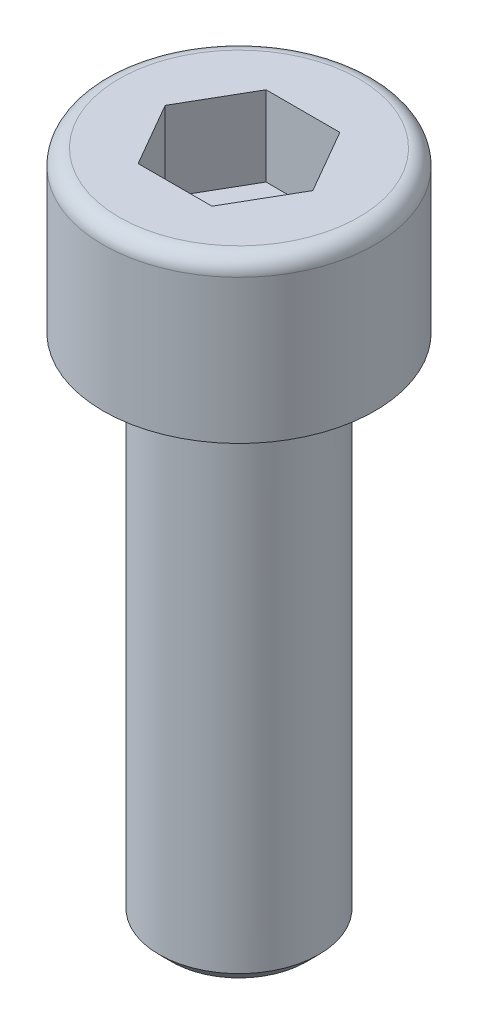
ISO-10303-21;
HEADER;
FILE_DESCRIPTION(('STEP AP214'),'2;1');
FILE_NAME('part.step','',(''),(''),'','','');
FILE_SCHEMA(('AUTOMOTIVE_DESIGN { 1 0 10303 214 1 1 1 1 }'));
ENDSEC;
DATA;
#1=APPLICATION_CONTEXT('core data for automotive mechanical design processes');
#2=APPLICATION_PROTOCOL_DEFINITION('international standard','automotive_design',2000,#1);
#3=PRODUCT_CONTEXT('',#1,'mechanical');
#4=PRODUCT('Part','Part','',(#3));
#5=PRODUCT_RELATED_PRODUCT_CATEGORY('part','',(#4));
#6=PRODUCT_DEFINITION_FORMATION('','',#4);
#7=PRODUCT_DEFINITION_CONTEXT('part definition',#1,'design');
#8=PRODUCT_DEFINITION('design','',#6,#7);
#9=PRODUCT_DEFINITION_SHAPE('','',#8);
#10=(LENGTH_UNIT() NAMED_UNIT(*) SI_UNIT(.MILLI.,.METRE.));
#11=(NAMED_UNIT(*) PLANE_ANGLE_UNIT() SI_UNIT($,.RADIAN.));
#12=(NAMED_UNIT(*) SI_UNIT($,.STERADIAN.) SOLID_ANGLE_UNIT());
#13=UNCERTAINTY_MEASURE_WITH_UNIT(LENGTH_MEASURE(1.E-05),#10,'distance_accuracy_value','');
#14=(GEOMETRIC_REPRESENTATION_CONTEXT(3) GLOBAL_UNCERTAINTY_ASSIGNED_CONTEXT((#13)) GLOBAL_UNIT_ASSIGNED_CONTEXT((#10,
#11,#12)) REPRESENTATION_CONTEXT('',''));
#15=CARTESIAN_POINT('',(0.,0.,0.));
#16=DIRECTION('',(0.,0.,1.));
#17=DIRECTION('',(1.,0.,0.));
#18=AXIS2_PLACEMENT_3D('',#15,#16,#17);
#19=CARTESIAN_POINT('',(-2.50000000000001,0.,0.));
#20=DIRECTION('',(0.,-1.,0.));
#21=DIRECTION('',(0.,0.,-1.));
#22=AXIS2_PLACEMENT_3D('',#19,#20,#21);
#23=PLANE('',#22);
#24=CARTESIAN_POINT('',(0.,0.,0.));
#25=DIRECTION('',(0.,-1.,0.));
#26=DIRECTION('',(0.,0.,-1.));
#27=AXIS2_PLACEMENT_3D('',#24,#25,#26);
#28=CIRCLE('',#27,2.1);
#29=CARTESIAN_POINT('',(0.,0.,-2.1));
#30=VERTEX_POINT('',#29);
#31=EDGE_CURVE('E11',#30,#30,#28,.T.);
#32=ORIENTED_EDGE('',*,*,#31,.T.);
#33=EDGE_LOOP('',(#32));
#34=FACE_BOUND('',#33,.T.);
#35=ADVANCED_FACE('F28',(#34),#23,.T.);
#36=CARTESIAN_POINT('',(0.,23.8098495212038,0.));
#37=DIRECTION('',(0.,1.,0.));
#38=DIRECTION('',(0.,0.,1.));
#39=AXIS2_PLACEMENT_3D('',#36,#37,#38);
#40=CYLINDRICAL_SURFACE('',#39,2.5);
#41=CARTESIAN_POINT('',(0.,0.400000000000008,0.));
#42=DIRECTION('',(0.,-1.,0.));
#43=DIRECTION('',(0.,0.,-1.));
#44=AXIS2_PLACEMENT_3D('',#41,#42,#43);
#45=CIRCLE('',#44,2.5);
#46=CARTESIAN_POINT('',(0.,0.400000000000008,-2.5));
#47=VERTEX_POINT('',#46);
#48=EDGE_CURVE('E35',#47,#47,#45,.F.);
#49=ORIENTED_EDGE('',*,*,#48,.T.);
#50=EDGE_LOOP('',(#49));
#51=FACE_BOUND('',#50,.T.);
#52=CARTESIAN_POINT('',(0.,16.,0.));
#53=DIRECTION('',(0.,1.,0.));
#54=DIRECTION('',(0.,0.,1.));
#55=AXIS2_PLACEMENT_3D('',#52,#53,#54);
#56=CIRCLE('',#55,2.5);
#57=CARTESIAN_POINT('',(0.,16.,2.5));
#58=VERTEX_POINT('',#57);
#59=EDGE_CURVE('E145',#58,#58,#56,.T.);
#60=ORIENTED_EDGE('',*,*,#59,.F.);
#61=EDGE_LOOP('',(#60));
#62=FACE_BOUND('',#61,.T.);
#63=ADVANCED_FACE('F150',(#51,#62),#40,.T.);
#64=CARTESIAN_POINT('',(-4.25,16.,0.));
#65=DIRECTION('',(0.,-1.,0.));
#66=DIRECTION('',(0.,0.,-1.));
#67=AXIS2_PLACEMENT_3D('',#64,#65,#66);
#68=PLANE('',#67);
#69=ORIENTED_EDGE('',*,*,#59,.T.);
#70=EDGE_LOOP('',(#69));
#71=FACE_BOUND('',#70,.T.);
#72=CARTESIAN_POINT('',(0.,16.,0.));
#73=DIRECTION('',(0.,1.,0.));
#74=DIRECTION('',(0.,0.,1.));
#75=AXIS2_PLACEMENT_3D('',#72,#73,#74);
#76=CIRCLE('',#75,4.25);
#77=CARTESIAN_POINT('',(0.,16.,4.25));
#78=VERTEX_POINT('',#77);
#79=EDGE_CURVE('E142',#78,#78,#76,.T.);
#80=ORIENTED_EDGE('',*,*,#79,.F.);
#81=EDGE_LOOP('',(#80));
#82=FACE_BOUND('',#81,.T.);
#83=ADVANCED_FACE('F169',(#71,#82),#68,.T.);
#84=CARTESIAN_POINT('',(0.,23.8098495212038,0.));
#85=DIRECTION('',(0.,1.,0.));
#86=DIRECTION('',(0.,0.,1.));
#87=AXIS2_PLACEMENT_3D('',#84,#85,#86);
#88=CYLINDRICAL_SURFACE('',#87,4.25);
#89=ORIENTED_EDGE('',*,*,#79,.T.);
#90=EDGE_LOOP('',(#89));
#91=FACE_BOUND('',#90,.T.);
#92=CARTESIAN_POINT('',(0.,20.5,0.));
#93=DIRECTION('',(0.,1.,0.));
#94=DIRECTION('',(0.,0.,1.));
#95=AXIS2_PLACEMENT_3D('',#92,#93,#94);
#96=CIRCLE('',#95,4.25);
#97=CARTESIAN_POINT('',(0.,20.5,4.25));
#98=VERTEX_POINT('',#97);
#99=EDGE_CURVE('E139',#98,#98,#96,.T.);
#100=ORIENTED_EDGE('',*,*,#99,.F.);
#101=EDGE_LOOP('',(#100));
#102=FACE_BOUND('',#101,.T.);
#103=ADVANCED_FACE('F173',(#91,#102),#88,.T.);
#104=CARTESIAN_POINT('',(0.,20.5,0.));
#105=DIRECTION('',(0.,1.,0.));
#106=DIRECTION('',(0.,0.,1.));
#107=AXIS2_PLACEMENT_3D('',#104,#105,#106);
#108=TOROIDAL_SURFACE('',#107,3.75,0.500000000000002);
#109=CARTESIAN_POINT('',(0.,21.,0.));
#110=DIRECTION('',(0.,1.,0.));
#111=DIRECTION('',(0.,0.,1.));
#112=AXIS2_PLACEMENT_3D('',#109,#110,#111);
#113=CIRCLE('',#112,3.75);
#114=CARTESIAN_POINT('',(0.,21.,3.75));
#115=VERTEX_POINT('',#114);
#116=EDGE_CURVE('E130',#115,#115,#113,.T.);
#117=ORIENTED_EDGE('',*,*,#116,.F.);
#118=EDGE_LOOP('',(#117));
#119=FACE_BOUND('',#118,.T.);
#120=ORIENTED_EDGE('',*,*,#99,.T.);
#121=EDGE_LOOP('',(#120));
#122=FACE_BOUND('',#121,.T.);
#123=ADVANCED_FACE('F179',(#119,#122),#108,.T.);
#124=CARTESIAN_POINT('',(0.,21.,0.));
#125=DIRECTION('',(0.,1.,0.));
#126=DIRECTION('',(0.,0.,1.));
#127=AXIS2_PLACEMENT_3D('',#124,#125,#126);
#128=PLANE('',#127);
#129=DIRECTION('',(0.5,0.,0.866025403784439));
#130=VECTOR('',#129,1.);
#131=CARTESIAN_POINT('',(-2.3094010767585,21.,0.));
#132=LINE('',#131,#130);
#133=CARTESIAN_POINT('',(-2.3094010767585,21.,0.));
#134=VERTEX_POINT('',#133);
#135=CARTESIAN_POINT('',(-1.15470053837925,21.,2.));
#136=VERTEX_POINT('',#135);
#137=EDGE_CURVE('E42',#134,#136,#132,.T.);
#138=ORIENTED_EDGE('',*,*,#137,.F.);
#139=DIRECTION('',(-0.5,0.,0.866025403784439));
#140=VECTOR('',#139,1.);
#141=CARTESIAN_POINT('',(-1.15470053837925,21.,-2.));
#142=LINE('',#141,#140);
#143=CARTESIAN_POINT('',(-1.15470053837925,21.,-2.));
#144=VERTEX_POINT('',#143);
#145=EDGE_CURVE('E112',#144,#134,#142,.T.);
#146=ORIENTED_EDGE('',*,*,#145,.F.);
#147=DIRECTION('',(-1.,0.,0.));
#148=VECTOR('',#147,1.);
#149=CARTESIAN_POINT('',(1.15470053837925,21.,-2.));
#150=LINE('',#149,#148);
#151=CARTESIAN_POINT('',(1.15470053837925,21.,-2.));
#152=VERTEX_POINT('',#151);
#153=EDGE_CURVE('E106',#152,#144,#150,.T.);
#154=ORIENTED_EDGE('',*,*,#153,.F.);
#155=DIRECTION('',(-0.5,0.,-0.866025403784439));
#156=VECTOR('',#155,1.);
#157=CARTESIAN_POINT('',(2.3094010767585,21.,0.));
#158=LINE('',#157,#156);
#159=CARTESIAN_POINT('',(2.3094010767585,21.,0.));
#160=VERTEX_POINT('',#159);
#161=EDGE_CURVE('E104',#160,#152,#158,.T.);
#162=ORIENTED_EDGE('',*,*,#161,.F.);
#163=DIRECTION('',(0.5,0.,-0.866025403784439));
#164=VECTOR('',#163,1.);
#165=CARTESIAN_POINT('',(1.15470053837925,21.,2.));
#166=LINE('',#165,#164);
#167=CARTESIAN_POINT('',(1.15470053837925,21.,2.));
#168=VERTEX_POINT('',#167);
#169=EDGE_CURVE('E85',#168,#160,#166,.T.);
#170=ORIENTED_EDGE('',*,*,#169,.F.);
#171=DIRECTION('',(1.,0.,0.));
#172=VECTOR('',#171,1.);
#173=CARTESIAN_POINT('',(-1.15470053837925,21.,2.));
#174=LINE('',#173,#172);
#175=EDGE_CURVE('E96',#136,#168,#174,.T.);
#176=ORIENTED_EDGE('',*,*,#175,.F.);
#177=EDGE_LOOP('',(#138,#146,#154,#162,#170,#176));
#178=FACE_BOUND('',#177,.T.);
#179=ORIENTED_EDGE('',*,*,#116,.T.);
#180=EDGE_LOOP('',(#179));
#181=FACE_BOUND('',#180,.T.);
#182=ADVANCED_FACE('F100',(#178,#181),#128,.T.);
#183=CARTESIAN_POINT('',(-2.3094010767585,18.5,0.));
#184=DIRECTION('',(-0.866025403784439,0.,0.5));
#185=DIRECTION('',(0.5,0.,0.866025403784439));
#186=AXIS2_PLACEMENT_3D('',#183,#184,#185);
#187=PLANE('',#186);
#188=ORIENTED_EDGE('',*,*,#137,.T.);
#189=DIRECTION('',(0.,1.,0.));
#190=VECTOR('',#189,1.);
#191=CARTESIAN_POINT('',(-1.15470053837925,18.5,2.));
#192=LINE('',#191,#190);
#193=CARTESIAN_POINT('',(-1.15470053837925,18.5,2.));
#194=VERTEX_POINT('',#193);
#195=EDGE_CURVE('E93',#194,#136,#192,.T.);
#196=ORIENTED_EDGE('',*,*,#195,.F.);
#197=DIRECTION('',(0.5,0.,0.866025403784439));
#198=VECTOR('',#197,1.);
#199=CARTESIAN_POINT('',(-2.3094010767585,18.5,0.));
#200=LINE('',#199,#198);
#201=CARTESIAN_POINT('',(-2.3094010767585,18.5,0.));
#202=VERTEX_POINT('',#201);
#203=EDGE_CURVE('E114',#202,#194,#200,.T.);
#204=ORIENTED_EDGE('',*,*,#203,.F.);
#205=DIRECTION('',(0.,1.,0.));
#206=VECTOR('',#205,1.);
#207=CARTESIAN_POINT('',(-2.3094010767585,18.5,0.));
#208=LINE('',#207,#206);
#209=EDGE_CURVE('E49',#202,#134,#208,.T.);
#210=ORIENTED_EDGE('',*,*,#209,.T.);
#211=EDGE_LOOP('',(#188,#196,#204,#210));
#212=FACE_BOUND('',#211,.T.);
#213=ADVANCED_FACE('F186',(#212),#187,.F.);
#214=CARTESIAN_POINT('',(-1.15470053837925,18.5,-2.));
#215=DIRECTION('',(-0.866025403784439,0.,-0.5));
#216=DIRECTION('',(-0.5,0.,0.866025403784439));
#217=AXIS2_PLACEMENT_3D('',#214,#215,#216);
#218=PLANE('',#217);
#219=ORIENTED_EDGE('',*,*,#145,.T.);
#220=ORIENTED_EDGE('',*,*,#209,.F.);
#221=DIRECTION('',(-0.5,0.,0.866025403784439));
#222=VECTOR('',#221,1.);
#223=CARTESIAN_POINT('',(-1.15470053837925,18.5,-2.));
#224=LINE('',#223,#222);
#225=CARTESIAN_POINT('',(-1.15470053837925,18.5,-2.));
#226=VERTEX_POINT('',#225);
#227=EDGE_CURVE('E126',#226,#202,#224,.T.);
#228=ORIENTED_EDGE('',*,*,#227,.F.);
#229=DIRECTION('',(0.,1.,0.));
#230=VECTOR('',#229,1.);
#231=CARTESIAN_POINT('',(-1.15470053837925,18.5,-2.));
#232=LINE('',#231,#230);
#233=EDGE_CURVE('E131',#226,#144,#232,.T.);
#234=ORIENTED_EDGE('',*,*,#233,.T.);
#235=EDGE_LOOP('',(#219,#220,#228,#234));
#236=FACE_BOUND('',#235,.T.);
#237=ADVANCED_FACE('F189',(#236),#218,.F.);
#238=CARTESIAN_POINT('',(1.15470053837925,18.5,-2.));
#239=DIRECTION('',(0.,0.,-1.));
#240=DIRECTION('',(-1.,0.,0.));
#241=AXIS2_PLACEMENT_3D('',#238,#239,#240);
#242=PLANE('',#241);
#243=ORIENTED_EDGE('',*,*,#153,.T.);
#244=ORIENTED_EDGE('',*,*,#233,.F.);
#245=DIRECTION('',(-1.,0.,0.));
#246=VECTOR('',#245,1.);
#247=CARTESIAN_POINT('',(1.15470053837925,18.5,-2.));
#248=LINE('',#247,#246);
#249=CARTESIAN_POINT('',(1.15470053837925,18.5,-2.));
#250=VERTEX_POINT('',#249);
#251=EDGE_CURVE('E123',#250,#226,#248,.T.);
#252=ORIENTED_EDGE('',*,*,#251,.F.);
#253=DIRECTION('',(0.,1.,0.));
#254=VECTOR('',#253,1.);
#255=CARTESIAN_POINT('',(1.15470053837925,18.5,-2.));
#256=LINE('',#255,#254);
#257=EDGE_CURVE('E133',#250,#152,#256,.T.);
#258=ORIENTED_EDGE('',*,*,#257,.T.);
#259=EDGE_LOOP('',(#243,#244,#252,#258));
#260=FACE_BOUND('',#259,.T.);
#261=ADVANCED_FACE('F197',(#260),#242,.F.);
#262=CARTESIAN_POINT('',(2.3094010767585,18.5,0.));
#263=DIRECTION('',(0.866025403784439,0.,-0.5));
#264=DIRECTION('',(-0.5,0.,-0.866025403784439));
#265=AXIS2_PLACEMENT_3D('',#262,#263,#264);
#266=PLANE('',#265);
#267=ORIENTED_EDGE('',*,*,#161,.T.);
#268=ORIENTED_EDGE('',*,*,#257,.F.);
#269=DIRECTION('',(-0.5,0.,-0.866025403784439));
#270=VECTOR('',#269,1.);
#271=CARTESIAN_POINT('',(2.3094010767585,18.5,0.));
#272=LINE('',#271,#270);
#273=CARTESIAN_POINT('',(2.3094010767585,18.5,0.));
#274=VERTEX_POINT('',#273);
#275=EDGE_CURVE('E120',#274,#250,#272,.T.);
#276=ORIENTED_EDGE('',*,*,#275,.F.);
#277=DIRECTION('',(0.,1.,0.));
#278=VECTOR('',#277,1.);
#279=CARTESIAN_POINT('',(2.3094010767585,18.5,0.));
#280=LINE('',#279,#278);
#281=EDGE_CURVE('E92',#274,#160,#280,.T.);
#282=ORIENTED_EDGE('',*,*,#281,.T.);
#283=EDGE_LOOP('',(#267,#268,#276,#282));
#284=FACE_BOUND('',#283,.T.);
#285=ADVANCED_FACE('F194',(#284),#266,.F.);
#286=CARTESIAN_POINT('',(1.15470053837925,18.5,2.));
#287=DIRECTION('',(0.866025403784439,0.,0.5));
#288=DIRECTION('',(0.5,0.,-0.866025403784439));
#289=AXIS2_PLACEMENT_3D('',#286,#287,#288);
#290=PLANE('',#289);
#291=ORIENTED_EDGE('',*,*,#169,.T.);
#292=ORIENTED_EDGE('',*,*,#281,.F.);
#293=DIRECTION('',(0.5,0.,-0.866025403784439));
#294=VECTOR('',#293,1.);
#295=CARTESIAN_POINT('',(1.15470053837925,18.5,2.));
#296=LINE('',#295,#294);
#297=CARTESIAN_POINT('',(1.15470053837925,18.5,2.));
#298=VERTEX_POINT('',#297);
#299=EDGE_CURVE('E88',#298,#274,#296,.T.);
#300=ORIENTED_EDGE('',*,*,#299,.F.);
#301=DIRECTION('',(0.,1.,0.));
#302=VECTOR('',#301,1.);
#303=CARTESIAN_POINT('',(1.15470053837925,18.5,2.));
#304=LINE('',#303,#302);
#305=EDGE_CURVE('E81',#298,#168,#304,.T.);
#306=ORIENTED_EDGE('',*,*,#305,.T.);
#307=EDGE_LOOP('',(#291,#292,#300,#306));
#308=FACE_BOUND('',#307,.T.);
#309=ADVANCED_FACE('F83',(#308),#290,.F.);
#310=CARTESIAN_POINT('',(-1.15470053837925,18.5,2.));
#311=DIRECTION('',(0.,0.,1.));
#312=DIRECTION('',(1.,0.,0.));
#313=AXIS2_PLACEMENT_3D('',#310,#311,#312);
#314=PLANE('',#313);
#315=ORIENTED_EDGE('',*,*,#175,.T.);
#316=ORIENTED_EDGE('',*,*,#305,.F.);
#317=DIRECTION('',(1.,0.,0.));
#318=VECTOR('',#317,1.);
#319=CARTESIAN_POINT('',(-1.15470053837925,18.5,2.));
#320=LINE('',#319,#318);
#321=EDGE_CURVE('E117',#194,#298,#320,.T.);
#322=ORIENTED_EDGE('',*,*,#321,.F.);
#323=ORIENTED_EDGE('',*,*,#195,.T.);
#324=EDGE_LOOP('',(#315,#316,#322,#323));
#325=FACE_BOUND('',#324,.T.);
#326=ADVANCED_FACE('F97',(#325),#314,.F.);
#327=CARTESIAN_POINT('',(-2.3094010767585,18.5,0.));
#328=DIRECTION('',(0.,-1.,0.));
#329=DIRECTION('',(0.,0.,-1.));
#330=AXIS2_PLACEMENT_3D('',#327,#328,#329);
#331=PLANE('',#330);
#332=ORIENTED_EDGE('',*,*,#203,.T.);
#333=ORIENTED_EDGE('',*,*,#321,.T.);
#334=ORIENTED_EDGE('',*,*,#299,.T.);
#335=ORIENTED_EDGE('',*,*,#275,.T.);
#336=ORIENTED_EDGE('',*,*,#251,.T.);
#337=ORIENTED_EDGE('',*,*,#227,.T.);
#338=EDGE_LOOP('',(#332,#333,#334,#335,#336,#337));
#339=FACE_BOUND('',#338,.T.);
#340=ADVANCED_FACE('F155',(#339),#331,.F.);
#341=CARTESIAN_POINT('',(0.,0.400000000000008,0.));
#342=DIRECTION('',(0.,1.,0.));
#343=DIRECTION('',(0.,0.,1.));
#344=AXIS2_PLACEMENT_3D('',#341,#342,#343);
#345=CONICAL_SURFACE('',#344,2.5,0.785398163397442);
#346=ORIENTED_EDGE('',*,*,#31,.F.);
#347=EDGE_LOOP('',(#346));
#348=FACE_BOUND('',#347,.T.);
#349=ORIENTED_EDGE('',*,*,#48,.F.);
#350=EDGE_LOOP('',(#349));
#351=FACE_BOUND('',#350,.T.);
#352=ADVANCED_FACE('F153',(#348,#351),#345,.T.);
#353=CLOSED_SHELL('',(#35,#63,#83,#103,#123,#182,#213,#237,#261,#285,#309,#326,#340,#352));
#354=MANIFOLD_SOLID_BREP('B2',#353);
#355=ADVANCED_BREP_SHAPE_REPRESENTATION('',(#18,#354),#14);
#356=SHAPE_DEFINITION_REPRESENTATION(#9,#355);
ENDSEC;
END-ISO-10303-21;
